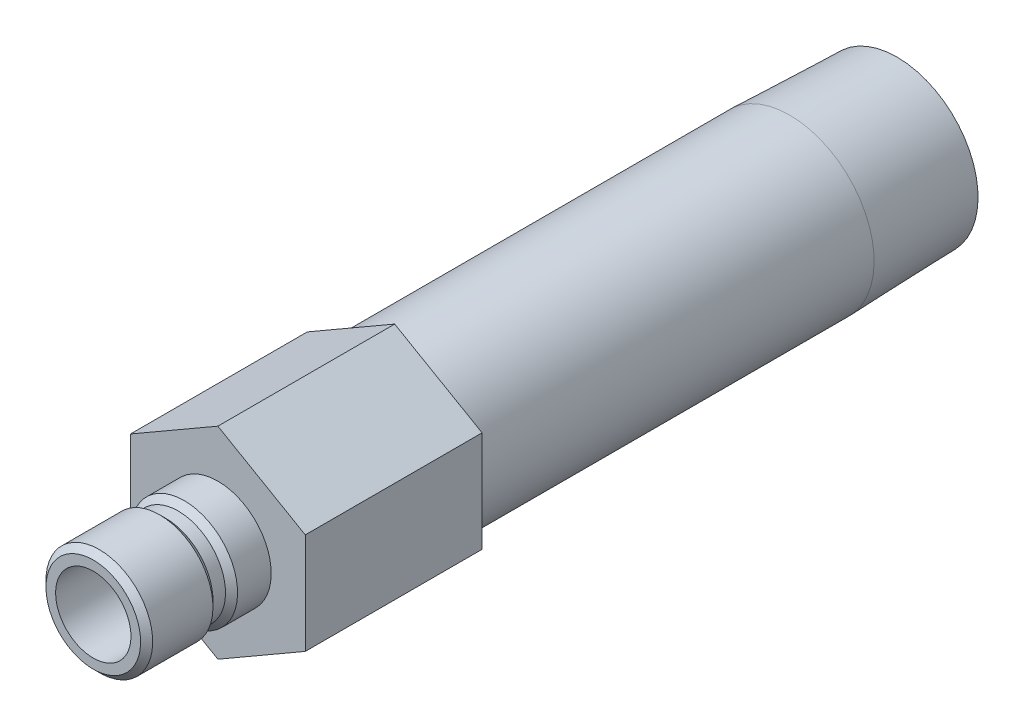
ISO-10303-21;
HEADER;
FILE_DESCRIPTION(('STEP AP214'),'2;1');
FILE_NAME('part.step','',(''),(''),'','','');
FILE_SCHEMA(('AUTOMOTIVE_DESIGN { 1 0 10303 214 1 1 1 1 }'));
ENDSEC;
DATA;
#1=APPLICATION_CONTEXT('core data for automotive mechanical design processes');
#2=APPLICATION_PROTOCOL_DEFINITION('international standard','automotive_design',2000,#1);
#3=PRODUCT_CONTEXT('',#1,'mechanical');
#4=PRODUCT('Part','Part','',(#3));
#5=PRODUCT_RELATED_PRODUCT_CATEGORY('part','',(#4));
#6=PRODUCT_DEFINITION_FORMATION('','',#4);
#7=PRODUCT_DEFINITION_CONTEXT('part definition',#1,'design');
#8=PRODUCT_DEFINITION('design','',#6,#7);
#9=PRODUCT_DEFINITION_SHAPE('','',#8);
#10=(LENGTH_UNIT() NAMED_UNIT(*) SI_UNIT(.MILLI.,.METRE.));
#11=(NAMED_UNIT(*) PLANE_ANGLE_UNIT() SI_UNIT($,.RADIAN.));
#12=(NAMED_UNIT(*) SI_UNIT($,.STERADIAN.) SOLID_ANGLE_UNIT());
#13=UNCERTAINTY_MEASURE_WITH_UNIT(LENGTH_MEASURE(1.E-05),#10,'distance_accuracy_value','');
#14=(GEOMETRIC_REPRESENTATION_CONTEXT(3) GLOBAL_UNCERTAINTY_ASSIGNED_CONTEXT((#13)) GLOBAL_UNIT_ASSIGNED_CONTEXT((#10,
#11,#12)) REPRESENTATION_CONTEXT('',''));
#15=CARTESIAN_POINT('',(0.,0.,0.));
#16=DIRECTION('',(0.,0.,1.));
#17=DIRECTION('',(1.,0.,0.));
#18=AXIS2_PLACEMENT_3D('',#15,#16,#17);
#19=CARTESIAN_POINT('',(0.,0.,0.));
#20=DIRECTION('',(0.,0.,-1.));
#21=DIRECTION('',(0.,1.,0.));
#22=AXIS2_PLACEMENT_3D('',#19,#20,#21);
#23=CYLINDRICAL_SURFACE('',#22,10.668);
#24=CARTESIAN_POINT('',(0.,0.,-72.2884));
#25=DIRECTION('',(0.,0.,-1.));
#26=DIRECTION('',(0.,1.,0.));
#27=AXIS2_PLACEMENT_3D('',#24,#25,#26);
#28=CIRCLE('',#27,10.668);
#29=CARTESIAN_POINT('',(0.,10.668,-72.2884));
#30=VERTEX_POINT('',#29);
#31=EDGE_CURVE('E168',#30,#30,#28,.T.);
#32=ORIENTED_EDGE('',*,*,#31,.F.);
#33=EDGE_LOOP('',(#32));
#34=FACE_BOUND('',#33,.T.);
#35=CARTESIAN_POINT('',(0.,0.,-22.352));
#36=DIRECTION('',(0.,0.,1.));
#37=DIRECTION('',(1.,0.,0.));
#38=AXIS2_PLACEMENT_3D('',#35,#36,#37);
#39=CIRCLE('',#38,10.668);
#40=CARTESIAN_POINT('',(10.668,0.,-22.352));
#41=VERTEX_POINT('',#40);
#42=EDGE_CURVE('E37',#41,#41,#39,.F.);
#43=ORIENTED_EDGE('',*,*,#42,.T.);
#44=EDGE_LOOP('',(#43));
#45=FACE_BOUND('',#44,.T.);
#46=ADVANCED_FACE('F33',(#34,#45),#23,.T.);
#47=CARTESIAN_POINT('',(0.,0.,0.));
#48=DIRECTION('',(0.,0.,-1.));
#49=DIRECTION('',(0.,1.,0.));
#50=AXIS2_PLACEMENT_3D('',#47,#48,#49);
#51=CYLINDRICAL_SURFACE('',#50,4.76249999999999);
#52=CARTESIAN_POINT('',(0.,0.,15.748));
#53=DIRECTION('',(0.,0.,-1.));
#54=DIRECTION('',(0.,1.,0.));
#55=AXIS2_PLACEMENT_3D('',#52,#53,#54);
#56=CIRCLE('',#55,4.7625);
#57=CARTESIAN_POINT('',(0.,4.7625,15.748));
#58=VERTEX_POINT('',#57);
#59=EDGE_CURVE('E144',#58,#58,#56,.T.);
#60=ORIENTED_EDGE('',*,*,#59,.F.);
#61=EDGE_LOOP('',(#60));
#62=FACE_BOUND('',#61,.T.);
#63=CARTESIAN_POINT('',(0.,0.,-22.352));
#64=DIRECTION('',(0.,0.,-1.));
#65=DIRECTION('',(0.,1.,0.));
#66=AXIS2_PLACEMENT_3D('',#63,#64,#65);
#67=CIRCLE('',#66,4.76249999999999);
#68=CARTESIAN_POINT('',(0.,4.7625,-22.352));
#69=VERTEX_POINT('',#68);
#70=EDGE_CURVE('E11',#69,#69,#67,.T.);
#71=ORIENTED_EDGE('',*,*,#70,.T.);
#72=EDGE_LOOP('',(#71));
#73=FACE_BOUND('',#72,.T.);
#74=ADVANCED_FACE('F35',(#62,#73),#51,.F.);
#75=CARTESIAN_POINT('',(0.,4.7625,-22.352));
#76=DIRECTION('',(0.,0.,-1.));
#77=DIRECTION('',(0.,1.,0.));
#78=AXIS2_PLACEMENT_3D('',#75,#76,#77);
#79=PLANE('',#78);
#80=CARTESIAN_POINT('',(0.,0.,-22.352));
#81=DIRECTION('',(0.,0.,-1.));
#82=DIRECTION('',(0.,1.,0.));
#83=AXIS2_PLACEMENT_3D('',#80,#81,#82);
#84=CIRCLE('',#83,7.89939999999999);
#85=CARTESIAN_POINT('',(0.,7.8994,-22.352));
#86=VERTEX_POINT('',#85);
#87=EDGE_CURVE('E43',#86,#86,#84,.T.);
#88=ORIENTED_EDGE('',*,*,#87,.T.);
#89=EDGE_LOOP('',(#88));
#90=FACE_BOUND('',#89,.T.);
#91=ORIENTED_EDGE('',*,*,#70,.F.);
#92=EDGE_LOOP('',(#91));
#93=FACE_BOUND('',#92,.T.);
#94=ADVANCED_FACE('F180',(#90,#93),#79,.T.);
#95=CARTESIAN_POINT('',(0.,0.,0.));
#96=DIRECTION('',(0.,0.,-1.));
#97=DIRECTION('',(0.,1.,0.));
#98=AXIS2_PLACEMENT_3D('',#95,#96,#97);
#99=CYLINDRICAL_SURFACE('',#98,7.89939999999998);
#100=CARTESIAN_POINT('',(0.,0.,-85.852));
#101=DIRECTION('',(0.,0.,-1.));
#102=DIRECTION('',(0.,1.,0.));
#103=AXIS2_PLACEMENT_3D('',#100,#101,#102);
#104=CIRCLE('',#103,7.89939999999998);
#105=CARTESIAN_POINT('',(0.,7.8994,-85.852));
#106=VERTEX_POINT('',#105);
#107=EDGE_CURVE('E174',#106,#106,#104,.T.);
#108=ORIENTED_EDGE('',*,*,#107,.T.);
#109=EDGE_LOOP('',(#108));
#110=FACE_BOUND('',#109,.T.);
#111=ORIENTED_EDGE('',*,*,#87,.F.);
#112=EDGE_LOOP('',(#111));
#113=FACE_BOUND('',#112,.T.);
#114=ADVANCED_FACE('F183',(#110,#113),#99,.F.);
#115=CARTESIAN_POINT('',(0.,10.244140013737,-85.852));
#116=DIRECTION('',(0.,0.,-1.));
#117=DIRECTION('',(0.,1.,0.));
#118=AXIS2_PLACEMENT_3D('',#115,#116,#117);
#119=PLANE('',#118);
#120=CARTESIAN_POINT('',(0.,0.,-85.852));
#121=DIRECTION('',(0.,0.,-1.));
#122=DIRECTION('',(0.,1.,0.));
#123=AXIS2_PLACEMENT_3D('',#120,#121,#122);
#124=CIRCLE('',#123,10.2441400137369);
#125=CARTESIAN_POINT('',(0.,10.244140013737,-85.852));
#126=VERTEX_POINT('',#125);
#127=EDGE_CURVE('E171',#126,#126,#124,.T.);
#128=ORIENTED_EDGE('',*,*,#127,.T.);
#129=EDGE_LOOP('',(#128));
#130=FACE_BOUND('',#129,.T.);
#131=ORIENTED_EDGE('',*,*,#107,.F.);
#132=EDGE_LOOP('',(#131));
#133=FACE_BOUND('',#132,.T.);
#134=ADVANCED_FACE('F185',(#130,#133),#119,.T.);
#135=CARTESIAN_POINT('',(0.,0.,-85.852));
#136=DIRECTION('',(0.,0.,1.));
#137=DIRECTION('',(0.,-1.,0.));
#138=AXIS2_PLACEMENT_3D('',#135,#136,#137);
#139=CONICAL_SURFACE('',#138,10.2441400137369,0.0312396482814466);
#140=ORIENTED_EDGE('',*,*,#31,.T.);
#141=EDGE_LOOP('',(#140));
#142=FACE_BOUND('',#141,.T.);
#143=ORIENTED_EDGE('',*,*,#127,.F.);
#144=EDGE_LOOP('',(#143));
#145=FACE_BOUND('',#144,.T.);
#146=ADVANCED_FACE('F192',(#142,#145),#139,.T.);
#147=CARTESIAN_POINT('',(0.,6.7437,0.));
#148=DIRECTION('',(0.,0.,1.));
#149=DIRECTION('',(0.,-1.,0.));
#150=AXIS2_PLACEMENT_3D('',#147,#148,#149);
#151=PLANE('',#150);
#152=CARTESIAN_POINT('',(0.,0.,0.));
#153=DIRECTION('',(0.,0.,-1.));
#154=DIRECTION('',(0.,1.,0.));
#155=AXIS2_PLACEMENT_3D('',#152,#153,#154);
#156=CIRCLE('',#155,6.7437);
#157=CARTESIAN_POINT('',(0.,6.7437,0.));
#158=VERTEX_POINT('',#157);
#159=EDGE_CURVE('E165',#158,#158,#156,.T.);
#160=ORIENTED_EDGE('',*,*,#159,.T.);
#161=EDGE_LOOP('',(#160));
#162=FACE_BOUND('',#161,.T.);
#163=DIRECTION('',(-0.866025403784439,-0.5,0.));
#164=VECTOR('',#163,1.);
#165=CARTESIAN_POINT('',(0.,12.7582862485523,0.));
#166=LINE('',#165,#164);
#167=CARTESIAN_POINT('',(0.,12.7582862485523,0.));
#168=VERTEX_POINT('',#167);
#169=CARTESIAN_POINT('',(-11.049,6.37914312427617,0.));
#170=VERTEX_POINT('',#169);
#171=EDGE_CURVE('E122',#168,#170,#166,.T.);
#172=ORIENTED_EDGE('',*,*,#171,.T.);
#173=DIRECTION('',(0.,-1.,0.));
#174=VECTOR('',#173,1.);
#175=CARTESIAN_POINT('',(-11.049,6.37914312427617,0.));
#176=LINE('',#175,#174);
#177=CARTESIAN_POINT('',(-11.049,-6.37914312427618,0.));
#178=VERTEX_POINT('',#177);
#179=EDGE_CURVE('E125',#170,#178,#176,.T.);
#180=ORIENTED_EDGE('',*,*,#179,.T.);
#181=DIRECTION('',(0.866025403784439,-0.5,0.));
#182=VECTOR('',#181,1.);
#183=CARTESIAN_POINT('',(-11.049,-6.37914312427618,0.));
#184=LINE('',#183,#182);
#185=CARTESIAN_POINT('',(0.,-12.7582862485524,0.));
#186=VERTEX_POINT('',#185);
#187=EDGE_CURVE('E128',#178,#186,#184,.T.);
#188=ORIENTED_EDGE('',*,*,#187,.T.);
#189=DIRECTION('',(0.866025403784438,0.5,0.));
#190=VECTOR('',#189,1.);
#191=CARTESIAN_POINT('',(0.,-12.7582862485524,0.));
#192=LINE('',#191,#190);
#193=CARTESIAN_POINT('',(11.049,-6.37914312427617,0.));
#194=VERTEX_POINT('',#193);
#195=EDGE_CURVE('E131',#186,#194,#192,.T.);
#196=ORIENTED_EDGE('',*,*,#195,.T.);
#197=DIRECTION('',(0.,1.,0.));
#198=VECTOR('',#197,1.);
#199=CARTESIAN_POINT('',(11.049,-6.37914312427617,0.));
#200=LINE('',#199,#198);
#201=CARTESIAN_POINT('',(11.049,6.37914312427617,0.));
#202=VERTEX_POINT('',#201);
#203=EDGE_CURVE('E99',#194,#202,#200,.T.);
#204=ORIENTED_EDGE('',*,*,#203,.T.);
#205=DIRECTION('',(-0.866025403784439,0.5,0.));
#206=VECTOR('',#205,1.);
#207=CARTESIAN_POINT('',(11.049,6.37914312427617,0.));
#208=LINE('',#207,#206);
#209=EDGE_CURVE('E134',#202,#168,#208,.T.);
#210=ORIENTED_EDGE('',*,*,#209,.T.);
#211=EDGE_LOOP('',(#172,#180,#188,#196,#204,#210));
#212=FACE_BOUND('',#211,.T.);
#213=ADVANCED_FACE('F206',(#162,#212),#151,.T.);
#214=CARTESIAN_POINT('',(0.,0.,0.));
#215=DIRECTION('',(0.,0.,-1.));
#216=DIRECTION('',(0.,1.,0.));
#217=AXIS2_PLACEMENT_3D('',#214,#215,#216);
#218=CYLINDRICAL_SURFACE('',#217,6.7437);
#219=CARTESIAN_POINT('',(0.,0.,4.25449999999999));
#220=DIRECTION('',(0.,0.,-1.));
#221=DIRECTION('',(0.,1.,0.));
#222=AXIS2_PLACEMENT_3D('',#219,#220,#221);
#223=CIRCLE('',#222,6.7437);
#224=CARTESIAN_POINT('',(0.,6.7437,4.25449999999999));
#225=VERTEX_POINT('',#224);
#226=EDGE_CURVE('E162',#225,#225,#223,.T.);
#227=ORIENTED_EDGE('',*,*,#226,.T.);
#228=EDGE_LOOP('',(#227));
#229=FACE_BOUND('',#228,.T.);
#230=ORIENTED_EDGE('',*,*,#159,.F.);
#231=EDGE_LOOP('',(#230));
#232=FACE_BOUND('',#231,.T.);
#233=ADVANCED_FACE('F213',(#229,#232),#218,.T.);
#234=CARTESIAN_POINT('',(0.,0.,4.25449999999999));
#235=DIRECTION('',(0.,0.,-1.));
#236=DIRECTION('',(0.,1.,0.));
#237=AXIS2_PLACEMENT_3D('',#234,#235,#236);
#238=CONICAL_SURFACE('',#237,6.7437,0.785398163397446);
#239=CARTESIAN_POINT('',(0.,0.,5.0165));
#240=DIRECTION('',(0.,0.,-1.));
#241=DIRECTION('',(0.,1.,0.));
#242=AXIS2_PLACEMENT_3D('',#239,#240,#241);
#243=CIRCLE('',#242,5.9817);
#244=CARTESIAN_POINT('',(0.,5.9817,5.0165));
#245=VERTEX_POINT('',#244);
#246=EDGE_CURVE('E159',#245,#245,#243,.T.);
#247=ORIENTED_EDGE('',*,*,#246,.T.);
#248=EDGE_LOOP('',(#247));
#249=FACE_BOUND('',#248,.T.);
#250=ORIENTED_EDGE('',*,*,#226,.F.);
#251=EDGE_LOOP('',(#250));
#252=FACE_BOUND('',#251,.T.);
#253=ADVANCED_FACE('F222',(#249,#252),#238,.T.);
#254=CARTESIAN_POINT('',(0.,0.,0.));
#255=DIRECTION('',(0.,0.,-1.));
#256=DIRECTION('',(0.,1.,0.));
#257=AXIS2_PLACEMENT_3D('',#254,#255,#256);
#258=CYLINDRICAL_SURFACE('',#257,5.9817);
#259=CARTESIAN_POINT('',(0.,0.,6.604));
#260=DIRECTION('',(0.,0.,-1.));
#261=DIRECTION('',(0.,1.,0.));
#262=AXIS2_PLACEMENT_3D('',#259,#260,#261);
#263=CIRCLE('',#262,5.9817);
#264=CARTESIAN_POINT('',(0.,5.9817,6.604));
#265=VERTEX_POINT('',#264);
#266=EDGE_CURVE('E156',#265,#265,#263,.T.);
#267=ORIENTED_EDGE('',*,*,#266,.T.);
#268=EDGE_LOOP('',(#267));
#269=FACE_BOUND('',#268,.T.);
#270=ORIENTED_EDGE('',*,*,#246,.F.);
#271=EDGE_LOOP('',(#270));
#272=FACE_BOUND('',#271,.T.);
#273=ADVANCED_FACE('F263',(#269,#272),#258,.T.);
#274=CARTESIAN_POINT('',(0.,0.,6.604));
#275=DIRECTION('',(0.,0.,1.));
#276=DIRECTION('',(0.,-1.,0.));
#277=AXIS2_PLACEMENT_3D('',#274,#275,#276);
#278=CONICAL_SURFACE('',#277,5.9817,0.785398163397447);
#279=CARTESIAN_POINT('',(0.,0.,7.366));
#280=DIRECTION('',(0.,0.,-1.));
#281=DIRECTION('',(0.,1.,0.));
#282=AXIS2_PLACEMENT_3D('',#279,#280,#281);
#283=CIRCLE('',#282,6.7437);
#284=CARTESIAN_POINT('',(0.,6.7437,7.366));
#285=VERTEX_POINT('',#284);
#286=EDGE_CURVE('E153',#285,#285,#283,.T.);
#287=ORIENTED_EDGE('',*,*,#286,.T.);
#288=EDGE_LOOP('',(#287));
#289=FACE_BOUND('',#288,.T.);
#290=ORIENTED_EDGE('',*,*,#266,.F.);
#291=EDGE_LOOP('',(#290));
#292=FACE_BOUND('',#291,.T.);
#293=ADVANCED_FACE('F259',(#289,#292),#278,.T.);
#294=CARTESIAN_POINT('',(0.,0.,0.));
#295=DIRECTION('',(0.,0.,-1.));
#296=DIRECTION('',(0.,1.,0.));
#297=AXIS2_PLACEMENT_3D('',#294,#295,#296);
#298=CYLINDRICAL_SURFACE('',#297,6.7437);
#299=CARTESIAN_POINT('',(0.,0.,14.986));
#300=DIRECTION('',(0.,0.,-1.));
#301=DIRECTION('',(0.,1.,0.));
#302=AXIS2_PLACEMENT_3D('',#299,#300,#301);
#303=CIRCLE('',#302,6.7437);
#304=CARTESIAN_POINT('',(0.,6.7437,14.986));
#305=VERTEX_POINT('',#304);
#306=EDGE_CURVE('E150',#305,#305,#303,.T.);
#307=ORIENTED_EDGE('',*,*,#306,.T.);
#308=EDGE_LOOP('',(#307));
#309=FACE_BOUND('',#308,.T.);
#310=ORIENTED_EDGE('',*,*,#286,.F.);
#311=EDGE_LOOP('',(#310));
#312=FACE_BOUND('',#311,.T.);
#313=ADVANCED_FACE('F255',(#309,#312),#298,.T.);
#314=CARTESIAN_POINT('',(0.,0.,14.986));
#315=DIRECTION('',(0.,0.,-1.));
#316=DIRECTION('',(0.,1.,0.));
#317=AXIS2_PLACEMENT_3D('',#314,#315,#316);
#318=CONICAL_SURFACE('',#317,6.7437,0.785398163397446);
#319=CARTESIAN_POINT('',(0.,0.,15.748));
#320=DIRECTION('',(0.,0.,-1.));
#321=DIRECTION('',(0.,1.,0.));
#322=AXIS2_PLACEMENT_3D('',#319,#320,#321);
#323=CIRCLE('',#322,5.9817);
#324=CARTESIAN_POINT('',(0.,5.9817,15.748));
#325=VERTEX_POINT('',#324);
#326=EDGE_CURVE('E147',#325,#325,#323,.T.);
#327=ORIENTED_EDGE('',*,*,#326,.T.);
#328=EDGE_LOOP('',(#327));
#329=FACE_BOUND('',#328,.T.);
#330=ORIENTED_EDGE('',*,*,#306,.F.);
#331=EDGE_LOOP('',(#330));
#332=FACE_BOUND('',#331,.T.);
#333=ADVANCED_FACE('F251',(#329,#332),#318,.T.);
#334=CARTESIAN_POINT('',(0.,4.7625,15.748));
#335=DIRECTION('',(0.,0.,1.));
#336=DIRECTION('',(0.,-1.,0.));
#337=AXIS2_PLACEMENT_3D('',#334,#335,#336);
#338=PLANE('',#337);
#339=ORIENTED_EDGE('',*,*,#59,.T.);
#340=EDGE_LOOP('',(#339));
#341=FACE_BOUND('',#340,.T.);
#342=ORIENTED_EDGE('',*,*,#326,.F.);
#343=EDGE_LOOP('',(#342));
#344=FACE_BOUND('',#343,.T.);
#345=ADVANCED_FACE('F239',(#341,#344),#338,.T.);
#346=CARTESIAN_POINT('',(0.,12.7582862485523,-22.352));
#347=DIRECTION('',(-0.5,0.866025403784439,0.));
#348=DIRECTION('',(-0.866025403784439,-0.5,0.));
#349=AXIS2_PLACEMENT_3D('',#346,#347,#348);
#350=PLANE('',#349);
#351=ORIENTED_EDGE('',*,*,#171,.F.);
#352=DIRECTION('',(0.,0.,1.));
#353=VECTOR('',#352,1.);
#354=CARTESIAN_POINT('',(0.,12.7582862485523,-22.352));
#355=LINE('',#354,#353);
#356=CARTESIAN_POINT('',(0.,12.7582862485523,-22.352));
#357=VERTEX_POINT('',#356);
#358=EDGE_CURVE('E51',#357,#168,#355,.T.);
#359=ORIENTED_EDGE('',*,*,#358,.F.);
#360=DIRECTION('',(-0.866025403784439,-0.5,0.));
#361=VECTOR('',#360,1.);
#362=CARTESIAN_POINT('',(0.,12.7582862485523,-22.352));
#363=LINE('',#362,#361);
#364=CARTESIAN_POINT('',(-11.049,6.37914312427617,-22.352));
#365=VERTEX_POINT('',#364);
#366=EDGE_CURVE('E137',#357,#365,#363,.T.);
#367=ORIENTED_EDGE('',*,*,#366,.T.);
#368=DIRECTION('',(0.,0.,1.));
#369=VECTOR('',#368,1.);
#370=CARTESIAN_POINT('',(-11.049,6.37914312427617,-22.352));
#371=LINE('',#370,#369);
#372=EDGE_CURVE('E86',#365,#170,#371,.T.);
#373=ORIENTED_EDGE('',*,*,#372,.T.);
#374=EDGE_LOOP('',(#351,#359,#367,#373));
#375=FACE_BOUND('',#374,.T.);
#376=ADVANCED_FACE('F226',(#375),#350,.T.);
#377=CARTESIAN_POINT('',(11.049,6.37914312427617,-22.352));
#378=DIRECTION('',(0.5,0.866025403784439,0.));
#379=DIRECTION('',(-0.866025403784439,0.5,0.));
#380=AXIS2_PLACEMENT_3D('',#377,#378,#379);
#381=PLANE('',#380);
#382=ORIENTED_EDGE('',*,*,#209,.F.);
#383=DIRECTION('',(0.,0.,1.));
#384=VECTOR('',#383,1.);
#385=CARTESIAN_POINT('',(11.049,6.37914312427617,-22.352));
#386=LINE('',#385,#384);
#387=CARTESIAN_POINT('',(11.049,6.37914312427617,-22.352));
#388=VERTEX_POINT('',#387);
#389=EDGE_CURVE('E74',#388,#202,#386,.T.);
#390=ORIENTED_EDGE('',*,*,#389,.F.);
#391=DIRECTION('',(-0.866025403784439,0.5,0.));
#392=VECTOR('',#391,1.);
#393=CARTESIAN_POINT('',(11.049,6.37914312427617,-22.352));
#394=LINE('',#393,#392);
#395=EDGE_CURVE('E112',#388,#357,#394,.T.);
#396=ORIENTED_EDGE('',*,*,#395,.T.);
#397=ORIENTED_EDGE('',*,*,#358,.T.);
#398=EDGE_LOOP('',(#382,#390,#396,#397));
#399=FACE_BOUND('',#398,.T.);
#400=ADVANCED_FACE('F231',(#399),#381,.T.);
#401=CARTESIAN_POINT('',(11.049,-6.37914312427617,-22.352));
#402=DIRECTION('',(1.,0.,0.));
#403=DIRECTION('',(0.,0.,-1.));
#404=AXIS2_PLACEMENT_3D('',#401,#402,#403);
#405=PLANE('',#404);
#406=ORIENTED_EDGE('',*,*,#203,.F.);
#407=DIRECTION('',(0.,0.,1.));
#408=VECTOR('',#407,1.);
#409=CARTESIAN_POINT('',(11.049,-6.37914312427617,-22.352));
#410=LINE('',#409,#408);
#411=CARTESIAN_POINT('',(11.049,-6.37914312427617,-22.352));
#412=VERTEX_POINT('',#411);
#413=EDGE_CURVE('E94',#412,#194,#410,.T.);
#414=ORIENTED_EDGE('',*,*,#413,.F.);
#415=DIRECTION('',(0.,1.,0.));
#416=VECTOR('',#415,1.);
#417=CARTESIAN_POINT('',(11.049,-6.37914312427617,-22.352));
#418=LINE('',#417,#416);
#419=EDGE_CURVE('E97',#412,#388,#418,.T.);
#420=ORIENTED_EDGE('',*,*,#419,.T.);
#421=ORIENTED_EDGE('',*,*,#389,.T.);
#422=EDGE_LOOP('',(#406,#414,#420,#421));
#423=FACE_BOUND('',#422,.T.);
#424=ADVANCED_FACE('F96',(#423),#405,.T.);
#425=CARTESIAN_POINT('',(0.,-12.7582862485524,-22.352));
#426=DIRECTION('',(0.5,-0.866025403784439,0.));
#427=DIRECTION('',(0.866025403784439,0.5,0.));
#428=AXIS2_PLACEMENT_3D('',#425,#426,#427);
#429=PLANE('',#428);
#430=ORIENTED_EDGE('',*,*,#195,.F.);
#431=DIRECTION('',(0.,0.,1.));
#432=VECTOR('',#431,1.);
#433=CARTESIAN_POINT('',(0.,-12.7582862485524,-22.352));
#434=LINE('',#433,#432);
#435=CARTESIAN_POINT('',(0.,-12.7582862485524,-22.352));
#436=VERTEX_POINT('',#435);
#437=EDGE_CURVE('E104',#436,#186,#434,.T.);
#438=ORIENTED_EDGE('',*,*,#437,.F.);
#439=DIRECTION('',(0.866025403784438,0.5,0.));
#440=VECTOR('',#439,1.);
#441=CARTESIAN_POINT('',(0.,-12.7582862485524,-22.352));
#442=LINE('',#441,#440);
#443=EDGE_CURVE('E110',#436,#412,#442,.T.);
#444=ORIENTED_EDGE('',*,*,#443,.T.);
#445=ORIENTED_EDGE('',*,*,#413,.T.);
#446=EDGE_LOOP('',(#430,#438,#444,#445));
#447=FACE_BOUND('',#446,.T.);
#448=ADVANCED_FACE('F114',(#447),#429,.T.);
#449=CARTESIAN_POINT('',(-11.049,-6.37914312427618,-22.352));
#450=DIRECTION('',(-0.5,-0.866025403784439,0.));
#451=DIRECTION('',(0.866025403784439,-0.5,0.));
#452=AXIS2_PLACEMENT_3D('',#449,#450,#451);
#453=PLANE('',#452);
#454=ORIENTED_EDGE('',*,*,#187,.F.);
#455=DIRECTION('',(0.,0.,1.));
#456=VECTOR('',#455,1.);
#457=CARTESIAN_POINT('',(-11.049,-6.37914312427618,-22.352));
#458=LINE('',#457,#456);
#459=CARTESIAN_POINT('',(-11.049,-6.37914312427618,-22.352));
#460=VERTEX_POINT('',#459);
#461=EDGE_CURVE('E141',#460,#178,#458,.T.);
#462=ORIENTED_EDGE('',*,*,#461,.F.);
#463=DIRECTION('',(0.866025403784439,-0.5,0.));
#464=VECTOR('',#463,1.);
#465=CARTESIAN_POINT('',(-11.049,-6.37914312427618,-22.352));
#466=LINE('',#465,#464);
#467=EDGE_CURVE('E115',#460,#436,#466,.T.);
#468=ORIENTED_EDGE('',*,*,#467,.T.);
#469=ORIENTED_EDGE('',*,*,#437,.T.);
#470=EDGE_LOOP('',(#454,#462,#468,#469));
#471=FACE_BOUND('',#470,.T.);
#472=ADVANCED_FACE('F230',(#471),#453,.T.);
#473=CARTESIAN_POINT('',(-11.049,6.37914312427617,-22.352));
#474=DIRECTION('',(-1.,0.,0.));
#475=DIRECTION('',(0.,0.,1.));
#476=AXIS2_PLACEMENT_3D('',#473,#474,#475);
#477=PLANE('',#476);
#478=ORIENTED_EDGE('',*,*,#179,.F.);
#479=ORIENTED_EDGE('',*,*,#372,.F.);
#480=DIRECTION('',(0.,-1.,0.));
#481=VECTOR('',#480,1.);
#482=CARTESIAN_POINT('',(-11.049,6.37914312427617,-22.352));
#483=LINE('',#482,#481);
#484=EDGE_CURVE('E117',#365,#460,#483,.T.);
#485=ORIENTED_EDGE('',*,*,#484,.T.);
#486=ORIENTED_EDGE('',*,*,#461,.T.);
#487=EDGE_LOOP('',(#478,#479,#485,#486));
#488=FACE_BOUND('',#487,.T.);
#489=ADVANCED_FACE('F227',(#488),#477,.T.);
#490=CARTESIAN_POINT('',(-11.049,6.37914312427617,-22.352));
#491=DIRECTION('',(0.,0.,1.));
#492=DIRECTION('',(1.,0.,0.));
#493=AXIS2_PLACEMENT_3D('',#490,#491,#492);
#494=PLANE('',#493);
#495=ORIENTED_EDGE('',*,*,#42,.F.);
#496=EDGE_LOOP('',(#495));
#497=FACE_BOUND('',#496,.T.);
#498=ORIENTED_EDGE('',*,*,#366,.F.);
#499=ORIENTED_EDGE('',*,*,#395,.F.);
#500=ORIENTED_EDGE('',*,*,#419,.F.);
#501=ORIENTED_EDGE('',*,*,#443,.F.);
#502=ORIENTED_EDGE('',*,*,#467,.F.);
#503=ORIENTED_EDGE('',*,*,#484,.F.);
#504=EDGE_LOOP('',(#498,#499,#500,#501,#502,#503));
#505=FACE_BOUND('',#504,.T.);
#506=ADVANCED_FACE('F108',(#497,#505),#494,.F.);
#507=CLOSED_SHELL('',(#46,#74,#94,#114,#134,#146,#213,#233,#253,#273,#293,#313,#333,#345,#376,
#400,#424,#448,#472,#489,#506));
#508=MANIFOLD_SOLID_BREP('B2',#507);
#509=ADVANCED_BREP_SHAPE_REPRESENTATION('',(#18,#508),#14);
#510=SHAPE_DEFINITION_REPRESENTATION(#9,#509);
ENDSEC;
END-ISO-10303-21;
